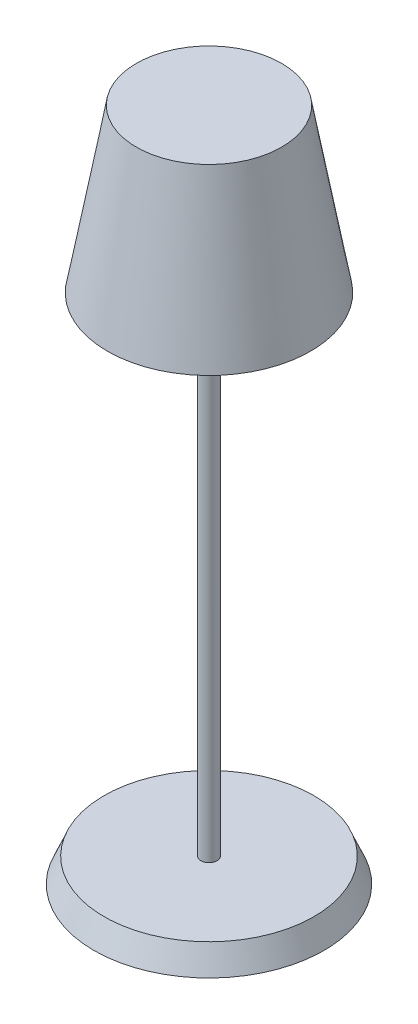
ISO-10303-21;
HEADER;
FILE_DESCRIPTION(('STEP AP214'),'2;1');
FILE_NAME('part.step','',(''),(''),'','','');
FILE_SCHEMA(('AUTOMOTIVE_DESIGN { 1 0 10303 214 1 1 1 1 }'));
ENDSEC;
DATA;
#1=APPLICATION_CONTEXT('core data for automotive mechanical design processes');
#2=APPLICATION_PROTOCOL_DEFINITION('international standard','automotive_design',2000,#1);
#3=PRODUCT_CONTEXT('',#1,'mechanical');
#4=PRODUCT('Part','Part','',(#3));
#5=PRODUCT_RELATED_PRODUCT_CATEGORY('part','',(#4));
#6=PRODUCT_DEFINITION_FORMATION('','',#4);
#7=PRODUCT_DEFINITION_CONTEXT('part definition',#1,'design');
#8=PRODUCT_DEFINITION('design','',#6,#7);
#9=PRODUCT_DEFINITION_SHAPE('','',#8);
#10=(LENGTH_UNIT() NAMED_UNIT(*) SI_UNIT(.MILLI.,.METRE.));
#11=(NAMED_UNIT(*) PLANE_ANGLE_UNIT() SI_UNIT($,.RADIAN.));
#12=(NAMED_UNIT(*) SI_UNIT($,.STERADIAN.) SOLID_ANGLE_UNIT());
#13=UNCERTAINTY_MEASURE_WITH_UNIT(LENGTH_MEASURE(1.E-05),#10,'distance_accuracy_value','');
#14=(GEOMETRIC_REPRESENTATION_CONTEXT(3) GLOBAL_UNCERTAINTY_ASSIGNED_CONTEXT((#13)) GLOBAL_UNIT_ASSIGNED_CONTEXT((#10,
#11,#12)) REPRESENTATION_CONTEXT('',''));
#15=CARTESIAN_POINT('',(0.,0.,0.));
#16=DIRECTION('',(0.,0.,1.));
#17=DIRECTION('',(1.,0.,0.));
#18=AXIS2_PLACEMENT_3D('',#15,#16,#17);
#19=CARTESIAN_POINT('',(0.,416.946697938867,0.));
#20=DIRECTION('',(0.,1.,0.));
#21=DIRECTION('',(0.,0.,1.));
#22=AXIS2_PLACEMENT_3D('',#19,#20,#21);
#23=PLANE('',#22);
#24=CARTESIAN_POINT('',(0.,416.946697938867,0.));
#25=DIRECTION('',(0.,1.,0.));
#26=DIRECTION('',(0.,0.,1.));
#27=AXIS2_PLACEMENT_3D('',#24,#25,#26);
#28=CIRCLE('',#27,39.5201976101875);
#29=CARTESIAN_POINT('',(0.,416.946697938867,39.5201976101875));
#30=VERTEX_POINT('',#29);
#31=EDGE_CURVE('E10',#30,#30,#28,.T.);
#32=ORIENTED_EDGE('',*,*,#31,.T.);
#33=EDGE_LOOP('',(#32));
#34=FACE_BOUND('',#33,.T.);
#35=CARTESIAN_POINT('',(0.,416.946697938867,0.));
#36=DIRECTION('',(0.,1.,0.));
#37=DIRECTION('',(0.,0.,1.));
#38=AXIS2_PLACEMENT_3D('',#35,#36,#37);
#39=CIRCLE('',#38,44.1631830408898);
#40=CARTESIAN_POINT('',(0.,416.946697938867,44.1631830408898));
#41=VERTEX_POINT('',#40);
#42=EDGE_CURVE('E43',#41,#41,#39,.F.);
#43=ORIENTED_EDGE('',*,*,#42,.T.);
#44=EDGE_LOOP('',(#43));
#45=FACE_BOUND('',#44,.T.);
#46=ADVANCED_FACE('F39',(#34,#45),#23,.F.);
#47=CARTESIAN_POINT('',(0.,417.946697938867,0.));
#48=DIRECTION('',(0.,1.,0.));
#49=DIRECTION('',(0.,0.,1.));
#50=AXIS2_PLACEMENT_3D('',#47,#48,#49);
#51=CONICAL_SURFACE('',#50,40.,0.447359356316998);
#52=CARTESIAN_POINT('',(0.,345.,0.));
#53=DIRECTION('',(0.,-1.,0.));
#54=DIRECTION('',(0.,0.,-1.));
#55=AXIS2_PLACEMENT_3D('',#52,#53,#54);
#56=CIRCLE('',#55,5.);
#57=CARTESIAN_POINT('',(0.,345.,5.00000000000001));
#58=VERTEX_POINT('',#57);
#59=EDGE_CURVE('E63',#58,#58,#56,.T.);
#60=CARTESIAN_POINT('',(0.,345.,5.00000000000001));
#61=CARTESIAN_POINT('',(0.,345.749444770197,5.35958539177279));
#62=CARTESIAN_POINT('',(0.,346.498889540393,5.71917078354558));
#63=CARTESIAN_POINT('',(0.,347.997779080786,6.43834156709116));
#64=CARTESIAN_POINT('',(0.,348.747223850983,6.79792695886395));
#65=CARTESIAN_POINT('',(0.,350.246113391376,7.51709774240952));
#66=CARTESIAN_POINT('',(0.,350.995558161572,7.8766831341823));
#67=CARTESIAN_POINT('',(0.,352.494447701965,8.59585391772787));
#68=CARTESIAN_POINT('',(0.,353.243892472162,8.95543930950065));
#69=CARTESIAN_POINT('',(0.,354.742782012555,9.67461009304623));
#70=CARTESIAN_POINT('',(0.,355.492226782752,10.034195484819));
#71=CARTESIAN_POINT('',(0.,356.991116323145,10.7533662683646));
#72=CARTESIAN_POINT('',(0.,357.740561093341,11.1129516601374));
#73=CARTESIAN_POINT('',(0.,359.239450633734,11.8321224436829));
#74=CARTESIAN_POINT('',(0.,359.988895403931,12.1917078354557));
#75=CARTESIAN_POINT('',(0.,361.487784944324,12.9108786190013));
#76=CARTESIAN_POINT('',(0.,362.23722971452,13.2704640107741));
#77=CARTESIAN_POINT('',(0.,363.736119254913,13.9896347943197));
#78=CARTESIAN_POINT('',(0.,364.48556402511,14.3492201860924));
#79=CARTESIAN_POINT('',(0.,365.984453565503,15.068390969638));
#80=CARTESIAN_POINT('',(0.,366.733898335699,15.4279763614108));
#81=CARTESIAN_POINT('',(0.,368.232787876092,16.1471471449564));
#82=CARTESIAN_POINT('',(0.,368.982232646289,16.5067325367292));
#83=CARTESIAN_POINT('',(0.,370.481122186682,17.2259033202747));
#84=CARTESIAN_POINT('',(0.,371.230566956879,17.5854887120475));
#85=CARTESIAN_POINT('',(0.,372.729456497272,18.3046594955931));
#86=CARTESIAN_POINT('',(0.,373.478901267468,18.6642448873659));
#87=CARTESIAN_POINT('',(0.,374.977790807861,19.3834156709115));
#88=CARTESIAN_POINT('',(0.,375.727235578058,19.7430010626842));
#89=CARTESIAN_POINT('',(0.,377.226125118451,20.4621718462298));
#90=CARTESIAN_POINT('',(0.,377.975569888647,20.8217572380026));
#91=CARTESIAN_POINT('',(0.,379.47445942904,21.5409280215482));
#92=CARTESIAN_POINT('',(0.,380.223904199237,21.900513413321));
#93=CARTESIAN_POINT('',(0.,381.72279373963,22.6196841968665));
#94=CARTESIAN_POINT('',(0.,382.472238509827,22.9792695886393));
#95=CARTESIAN_POINT('',(0.,383.97112805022,23.6984403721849));
#96=CARTESIAN_POINT('',(0.,384.720572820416,24.0580257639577));
#97=CARTESIAN_POINT('',(0.,386.219462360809,24.7771965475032));
#98=CARTESIAN_POINT('',(0.,386.968907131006,25.136781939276));
#99=CARTESIAN_POINT('',(0.,388.467796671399,25.8559527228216));
#100=CARTESIAN_POINT('',(0.,389.217241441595,26.2155381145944));
#101=CARTESIAN_POINT('',(0.,390.716130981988,26.93470889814));
#102=CARTESIAN_POINT('',(0.,391.465575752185,27.2942942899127));
#103=CARTESIAN_POINT('',(0.,392.964465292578,28.0134650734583));
#104=CARTESIAN_POINT('',(0.,393.713910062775,28.3730504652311));
#105=CARTESIAN_POINT('',(0.,395.212799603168,29.0922212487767));
#106=CARTESIAN_POINT('',(0.,395.962244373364,29.4518066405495));
#107=CARTESIAN_POINT('',(0.,397.461133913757,30.170977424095));
#108=CARTESIAN_POINT('',(0.,398.210578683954,30.5305628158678));
#109=CARTESIAN_POINT('',(0.,399.709468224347,31.2497335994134));
#110=CARTESIAN_POINT('',(0.,400.458912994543,31.6093189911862));
#111=CARTESIAN_POINT('',(0.,401.957802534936,32.3284897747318));
#112=CARTESIAN_POINT('',(0.,402.707247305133,32.6880751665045));
#113=CARTESIAN_POINT('',(0.,404.206136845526,33.4072459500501));
#114=CARTESIAN_POINT('',(0.,404.955581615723,33.7668313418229));
#115=CARTESIAN_POINT('',(0.,406.454471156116,34.4860021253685));
#116=CARTESIAN_POINT('',(0.,407.203915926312,34.8455875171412));
#117=CARTESIAN_POINT('',(0.,408.702805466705,35.5647583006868));
#118=CARTESIAN_POINT('',(0.,409.452250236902,35.9243436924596));
#119=CARTESIAN_POINT('',(0.,410.951139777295,36.6435144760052));
#120=CARTESIAN_POINT('',(0.,411.700584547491,37.003099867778));
#121=CARTESIAN_POINT('',(0.,413.199474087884,37.7222706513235));
#122=CARTESIAN_POINT('',(0.,413.948918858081,38.0818560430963));
#123=CARTESIAN_POINT('',(0.,415.447808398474,38.8010268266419));
#124=CARTESIAN_POINT('',(0.,416.19725316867,39.1606122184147));
#125=CARTESIAN_POINT('',(0.,416.946697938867,39.5201976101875));
#126=B_SPLINE_CURVE_WITH_KNOTS('',3,(#60,#61,#62,#63,#64,#65,#66,#67,#68,#69,#70,#71,#72,#73,
#74,#75,#76,#77,#78,#79,#80,#81,#82,#83,#84,#85,#86,#87,#88,#89,#90,#91,#92,#93,#94,#95,#96,#97,
#98,#99,#100,#101,#102,#103,#104,#105,#106,#107,#108,#109,#110,#111,#112,#113,#114,#115,#116,
#117,#118,#119,#120,#121,#122,#123,#124,#125),.UNSPECIFIED.,.F.,.F.,(4,2,2,2,2,2,2,2,2,2,2,2,2,
2,2,2,2,2,2,2,2,2,2,2,2,2,2,2,2,2,2,2,4),(0.,2.49373656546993,4.98747313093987,7.4812096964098,
9.97494626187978,12.4686828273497,14.9624193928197,17.4561559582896,19.9498925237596,
22.4436290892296,24.9373656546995,27.4311022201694,29.9248387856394,32.4185753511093,
34.9123119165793,37.4060484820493,39.8997850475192,42.3935216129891,44.8872581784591,
47.380994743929,49.874731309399,52.368467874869,54.8622044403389,57.3559410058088,
59.8496775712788,62.3434141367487,64.8371507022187,67.3308872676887,69.8246238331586,
72.3183603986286,74.8120969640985,77.3058335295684,79.7995700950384),.UNSPECIFIED.);
#127=EDGE_CURVE('BSEAM99',#58,#30,#126,.T.);
#128=ORIENTED_EDGE('',*,*,#59,.F.);
#129=ORIENTED_EDGE('',*,*,#31,.F.);
#130=ORIENTED_EDGE('',*,*,#127,.T.);
#131=ORIENTED_EDGE('',*,*,#127,.F.);
#132=EDGE_LOOP('',(#128,#130,#129,#131));
#133=FACE_BOUND('',#132,.T.);
#134=ADVANCED_FACE('F99',(#133),#51,.T.);
#135=CARTESIAN_POINT('',(0.,0.,0.));
#136=DIRECTION('',(0.,-1.,0.));
#137=DIRECTION('',(0.,0.,-1.));
#138=AXIS2_PLACEMENT_3D('',#135,#136,#137);
#139=PLANE('',#138);
#140=CARTESIAN_POINT('',(0.,0.,0.));
#141=DIRECTION('',(0.,-1.,0.));
#142=DIRECTION('',(0.,0.,-1.));
#143=AXIS2_PLACEMENT_3D('',#140,#141,#142);
#144=CIRCLE('',#143,71.296789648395);
#145=CARTESIAN_POINT('',(0.,0.,-71.296789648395));
#146=VERTEX_POINT('',#145);
#147=EDGE_CURVE('E48',#146,#146,#144,.T.);
#148=ORIENTED_EDGE('',*,*,#147,.T.);
#149=EDGE_LOOP('',(#148));
#150=FACE_BOUND('',#149,.T.);
#151=ADVANCED_FACE('F104',(#150),#139,.T.);
#152=CARTESIAN_POINT('',(0.,15.,0.));
#153=DIRECTION('',(0.,-1.,0.));
#154=DIRECTION('',(0.,0.,-1.));
#155=AXIS2_PLACEMENT_3D('',#152,#153,#154);
#156=CONICAL_SURFACE('',#155,65.,0.39744604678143);
#157=ORIENTED_EDGE('',*,*,#147,.F.);
#158=EDGE_LOOP('',(#157));
#159=FACE_BOUND('',#158,.T.);
#160=CARTESIAN_POINT('',(0.,15.,0.));
#161=DIRECTION('',(0.,-1.,0.));
#162=DIRECTION('',(0.,0.,-1.));
#163=AXIS2_PLACEMENT_3D('',#160,#161,#162);
#164=CIRCLE('',#163,65.);
#165=CARTESIAN_POINT('',(0.,15.,-65.));
#166=VERTEX_POINT('',#165);
#167=EDGE_CURVE('E53',#166,#166,#164,.T.);
#168=ORIENTED_EDGE('',*,*,#167,.T.);
#169=EDGE_LOOP('',(#168));
#170=FACE_BOUND('',#169,.T.);
#171=ADVANCED_FACE('F116',(#159,#170),#156,.T.);
#172=CARTESIAN_POINT('',(0.,15.,0.));
#173=DIRECTION('',(0.,-1.,0.));
#174=DIRECTION('',(0.,0.,-1.));
#175=AXIS2_PLACEMENT_3D('',#172,#173,#174);
#176=PLANE('',#175);
#177=ORIENTED_EDGE('',*,*,#167,.F.);
#178=EDGE_LOOP('',(#177));
#179=FACE_BOUND('',#178,.T.);
#180=CARTESIAN_POINT('',(0.,15.,0.));
#181=DIRECTION('',(0.,-1.,0.));
#182=DIRECTION('',(0.,0.,-1.));
#183=AXIS2_PLACEMENT_3D('',#180,#181,#182);
#184=CIRCLE('',#183,5.);
#185=CARTESIAN_POINT('',(0.,15.,-5.));
#186=VERTEX_POINT('',#185);
#187=EDGE_CURVE('E59',#186,#186,#184,.T.);
#188=ORIENTED_EDGE('',*,*,#187,.T.);
#189=EDGE_LOOP('',(#188));
#190=FACE_BOUND('',#189,.T.);
#191=ADVANCED_FACE('F112',(#179,#190),#176,.F.);
#192=CARTESIAN_POINT('',(0.,0.,0.));
#193=DIRECTION('',(0.,-1.,0.));
#194=DIRECTION('',(0.,0.,-1.));
#195=AXIS2_PLACEMENT_3D('',#192,#193,#194);
#196=CYLINDRICAL_SURFACE('',#195,5.);
#197=ORIENTED_EDGE('',*,*,#59,.T.);
#198=EDGE_LOOP('',(#197));
#199=FACE_BOUND('',#198,.T.);
#200=ORIENTED_EDGE('',*,*,#187,.F.);
#201=EDGE_LOOP('',(#200));
#202=FACE_BOUND('',#201,.T.);
#203=ADVANCED_FACE('F109',(#199,#202),#196,.T.);
#204=CARTESIAN_POINT('',(0.,417.770409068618,0.));
#205=DIRECTION('',(0.,-1.,0.));
#206=DIRECTION('',(0.,0.,-1.));
#207=AXIS2_PLACEMENT_3D('',#204,#205,#206);
#208=CONICAL_SURFACE('',#207,44.0156615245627,0.177214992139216);
#209=CARTESIAN_POINT('',(0.,317.264389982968,0.));
#210=DIRECTION('',(0.,-1.,0.));
#211=DIRECTION('',(0.,0.,-1.));
#212=AXIS2_PLACEMENT_3D('',#209,#210,#211);
#213=CIRCLE('',#212,62.0156615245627);
#214=CARTESIAN_POINT('',(0.,317.264389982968,-62.0156615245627));
#215=VERTEX_POINT('',#214);
#216=EDGE_CURVE('E75',#215,#215,#213,.T.);
#217=ORIENTED_EDGE('',*,*,#216,.T.);
#218=EDGE_LOOP('',(#217));
#219=FACE_BOUND('',#218,.T.);
#220=ORIENTED_EDGE('',*,*,#42,.F.);
#221=EDGE_LOOP('',(#220));
#222=FACE_BOUND('',#221,.T.);
#223=ADVANCED_FACE('F80',(#219,#222),#208,.F.);
#224=CARTESIAN_POINT('',(0.,317.440678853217,0.));
#225=DIRECTION('',(0.,1.,0.));
#226=DIRECTION('',(0.,0.,1.));
#227=AXIS2_PLACEMENT_3D('',#224,#225,#226);
#228=CONICAL_SURFACE('',#227,63.,1.39358133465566);
#229=ORIENTED_EDGE('',*,*,#216,.F.);
#230=EDGE_LOOP('',(#229));
#231=FACE_BOUND('',#230,.T.);
#232=CARTESIAN_POINT('',(0.,317.440678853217,0.));
#233=DIRECTION('',(0.,-1.,0.));
#234=DIRECTION('',(0.,0.,-1.));
#235=AXIS2_PLACEMENT_3D('',#232,#233,#234);
#236=CIRCLE('',#235,63.);
#237=CARTESIAN_POINT('',(0.,317.440678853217,-63.));
#238=VERTEX_POINT('',#237);
#239=EDGE_CURVE('E67',#238,#238,#236,.T.);
#240=ORIENTED_EDGE('',*,*,#239,.T.);
#241=EDGE_LOOP('',(#240));
#242=FACE_BOUND('',#241,.T.);
#243=ADVANCED_FACE('F83',(#231,#242),#228,.T.);
#244=CARTESIAN_POINT('',(0.,417.946697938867,0.));
#245=DIRECTION('',(0.,-1.,0.));
#246=DIRECTION('',(0.,0.,-1.));
#247=AXIS2_PLACEMENT_3D('',#244,#245,#246);
#248=CONICAL_SURFACE('',#247,45.,0.177214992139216);
#249=ORIENTED_EDGE('',*,*,#239,.F.);
#250=EDGE_LOOP('',(#249));
#251=FACE_BOUND('',#250,.T.);
#252=CARTESIAN_POINT('',(0.,417.946697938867,0.));
#253=DIRECTION('',(0.,-1.,0.));
#254=DIRECTION('',(0.,0.,-1.));
#255=AXIS2_PLACEMENT_3D('',#252,#253,#254);
#256=CIRCLE('',#255,45.);
#257=CARTESIAN_POINT('',(0.,417.946697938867,-45.));
#258=VERTEX_POINT('',#257);
#259=EDGE_CURVE('E71',#258,#258,#256,.T.);
#260=ORIENTED_EDGE('',*,*,#259,.T.);
#261=EDGE_LOOP('',(#260));
#262=FACE_BOUND('',#261,.T.);
#263=ADVANCED_FACE('F86',(#251,#262),#248,.T.);
#264=CARTESIAN_POINT('',(0.,417.946697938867,0.));
#265=DIRECTION('',(0.,-1.,0.));
#266=DIRECTION('',(0.,0.,-1.));
#267=AXIS2_PLACEMENT_3D('',#264,#265,#266);
#268=PLANE('',#267);
#269=ORIENTED_EDGE('',*,*,#259,.F.);
#270=EDGE_LOOP('',(#269));
#271=FACE_BOUND('',#270,.T.);
#272=ADVANCED_FACE('F41',(#271),#268,.F.);
#273=CLOSED_SHELL('',(#46,#134,#151,#171,#191,#203,#223,#243,#263,#272));
#274=MANIFOLD_SOLID_BREP('B2',#273);
#275=ADVANCED_BREP_SHAPE_REPRESENTATION('',(#18,#274),#14);
#276=SHAPE_DEFINITION_REPRESENTATION(#9,#275);
ENDSEC;
END-ISO-10303-21;
